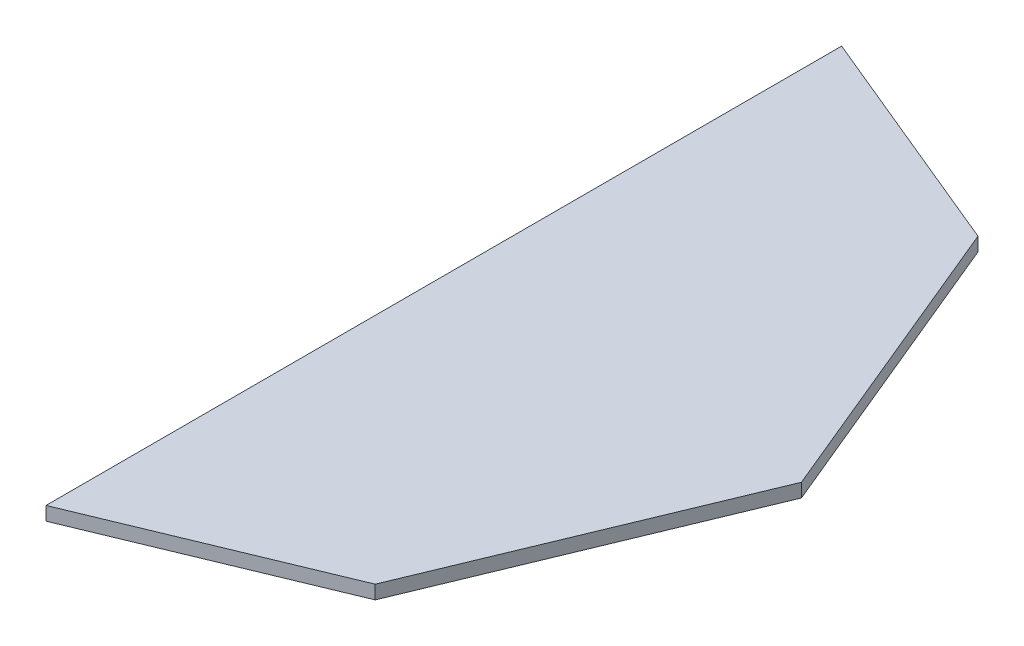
from build123d import *

# Parameters (mm, degrees)
BOSS_EXTRUDE1_DEPTH = 12


with BuildPart() as part:
    # Sketch1 → Boss-Extrude1 (new body)
    with BuildSketch(Plane(origin=(0, 0, 0), x_dir=(1, 0, 0), z_dir=(0, 1, 0))):
        Polygon((60.355339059, 350), (60.355339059, -350), (265.165042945, -265.165042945), (375, 0), (265.165042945, 265.165042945), align=None)
    extrude(amount=BOSS_EXTRUDE1_DEPTH)


solid = part.part
